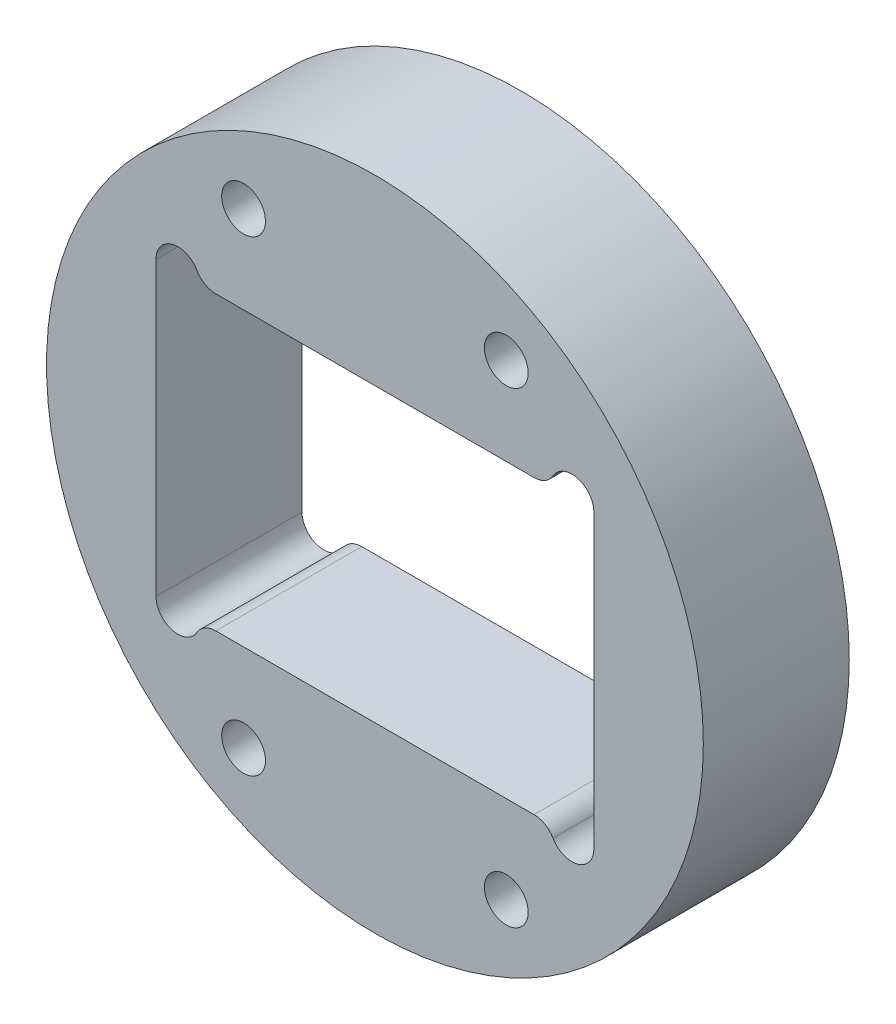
from build123d import *

# Parameters (mm, degrees)
ESQUISSE1_R        = 22.5
ESQUISSE1_R_2      = 1.5
BOSS_EXTRU_1_DEPTH = 10


with BuildPart() as part:
    # Esquisse1 → Boss.-Extru.1 (new body)
    with BuildSketch(Plane.XY):
        with Locations((-62.046476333, 20.020145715)):
            Circle(ESQUISSE1_R)
        with Locations((-71.046476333, 36.020145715)):
            Circle(ESQUISSE1_R_2, mode=Mode.SUBTRACT)
        with Locations((-53.046476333, 36.020145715)):
            Circle(ESQUISSE1_R_2, mode=Mode.SUBTRACT)
        with Locations((-53.046476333, 4.020145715)):
            Circle(ESQUISSE1_R_2, mode=Mode.SUBTRACT)
        with Locations((-71.046476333, 4.020145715)):
            Circle(ESQUISSE1_R_2, mode=Mode.SUBTRACT)
        with BuildLine():
            Line((-47.046476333, 30.020145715), (-47.046476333, 10.020145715))
            ThreePointArc((-47.046476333, 10.020145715), (-48.158247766, 8.571256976), (-49.845514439, 9.270145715))
            ThreePointArc((-49.845514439, 9.270145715), (-50.394552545, 9.819183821), (-51.144552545, 10.020145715))
            Line((-51.144552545, 10.020145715), (-72.948400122, 10.020145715))
            ThreePointArc((-72.948400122, 10.020145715), (-73.698400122, 9.819183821), (-74.247438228, 9.270145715))
            ThreePointArc((-74.247438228, 9.270145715), (-75.934704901, 8.571256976), (-77.046476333, 10.020145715))
            Line((-77.046476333, 10.020145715), (-77.046476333, 30.020145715))
            ThreePointArc((-77.046476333, 30.020145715), (-75.934704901, 31.469034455), (-74.247438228, 30.770145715))
            ThreePointArc((-74.247438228, 30.770145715), (-73.698400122, 30.22110761), (-72.948400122, 30.020145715))
            Line((-72.948400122, 30.020145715), (-51.144552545, 30.020145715))
            ThreePointArc((-51.144552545, 30.020145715), (-50.394552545, 30.22110761), (-49.845514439, 30.770145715))
            ThreePointArc((-49.845514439, 30.770145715), (-48.158247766, 31.469034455), (-47.046476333, 30.020145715))
        make_face(mode=Mode.SUBTRACT)
    extrude(amount=BOSS_EXTRU_1_DEPTH)


solid = part.part
